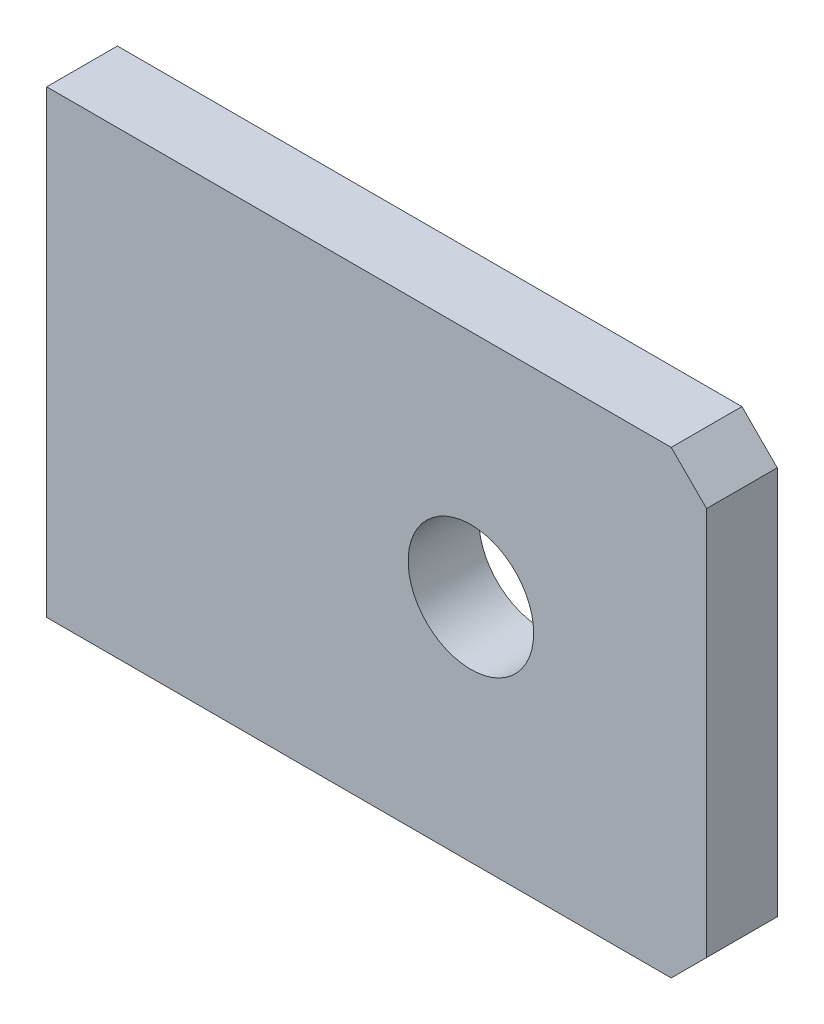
ISO-10303-21;
HEADER;
FILE_DESCRIPTION(('STEP AP214'),'2;1');
FILE_NAME('part.step','',(''),(''),'','','');
FILE_SCHEMA(('AUTOMOTIVE_DESIGN { 1 0 10303 214 1 1 1 1 }'));
ENDSEC;
DATA;
#1=APPLICATION_CONTEXT('core data for automotive mechanical design processes');
#2=APPLICATION_PROTOCOL_DEFINITION('international standard','automotive_design',2000,#1);
#3=PRODUCT_CONTEXT('',#1,'mechanical');
#4=PRODUCT('Part','Part','',(#3));
#5=PRODUCT_RELATED_PRODUCT_CATEGORY('part','',(#4));
#6=PRODUCT_DEFINITION_FORMATION('','',#4);
#7=PRODUCT_DEFINITION_CONTEXT('part definition',#1,'design');
#8=PRODUCT_DEFINITION('design','',#6,#7);
#9=PRODUCT_DEFINITION_SHAPE('','',#8);
#10=(LENGTH_UNIT() NAMED_UNIT(*) SI_UNIT(.MILLI.,.METRE.));
#11=(NAMED_UNIT(*) PLANE_ANGLE_UNIT() SI_UNIT($,.RADIAN.));
#12=(NAMED_UNIT(*) SI_UNIT($,.STERADIAN.) SOLID_ANGLE_UNIT());
#13=UNCERTAINTY_MEASURE_WITH_UNIT(LENGTH_MEASURE(1.E-05),#10,'distance_accuracy_value','');
#14=(GEOMETRIC_REPRESENTATION_CONTEXT(3) GLOBAL_UNCERTAINTY_ASSIGNED_CONTEXT((#13)) GLOBAL_UNIT_ASSIGNED_CONTEXT((#10,
#11,#12)) REPRESENTATION_CONTEXT('',''));
#15=CARTESIAN_POINT('',(0.,0.,0.));
#16=DIRECTION('',(0.,0.,1.));
#17=DIRECTION('',(1.,0.,0.));
#18=AXIS2_PLACEMENT_3D('',#15,#16,#17);
#19=CARTESIAN_POINT('',(0.,0.,0.));
#20=DIRECTION('',(0.,0.,-1.));
#21=DIRECTION('',(-1.,0.,0.));
#22=AXIS2_PLACEMENT_3D('',#19,#20,#21);
#23=PLANE('',#22);
#24=DIRECTION('',(1.,0.,0.));
#25=VECTOR('',#24,1.);
#26=CARTESIAN_POINT('',(-7.112,-4.953,0.));
#27=LINE('',#26,#25);
#28=CARTESIAN_POINT('',(-7.112,-4.953,0.));
#29=VERTEX_POINT('',#28);
#30=CARTESIAN_POINT('',(6.35,-4.953,0.));
#31=VERTEX_POINT('',#30);
#32=EDGE_CURVE('E118',#29,#31,#27,.T.);
#33=ORIENTED_EDGE('',*,*,#32,.T.);
#34=DIRECTION('',(-0.707106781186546,-0.707106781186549,0.));
#35=VECTOR('',#34,1.);
#36=CARTESIAN_POINT('',(6.35,-4.953,0.));
#37=LINE('',#36,#35);
#38=CARTESIAN_POINT('',(7.112,-4.19099999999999,0.));
#39=VERTEX_POINT('',#38);
#40=EDGE_CURVE('E127',#31,#39,#37,.F.);
#41=ORIENTED_EDGE('',*,*,#40,.T.);
#42=DIRECTION('',(0.,1.,0.));
#43=VECTOR('',#42,1.);
#44=CARTESIAN_POINT('',(7.112,-4.953,0.));
#45=LINE('',#44,#43);
#46=CARTESIAN_POINT('',(7.112,4.191,0.));
#47=VERTEX_POINT('',#46);
#48=EDGE_CURVE('E111',#39,#47,#45,.T.);
#49=ORIENTED_EDGE('',*,*,#48,.T.);
#50=DIRECTION('',(0.707106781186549,-0.707106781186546,0.));
#51=VECTOR('',#50,1.);
#52=CARTESIAN_POINT('',(7.112,4.191,0.));
#53=LINE('',#52,#51);
#54=CARTESIAN_POINT('',(6.34999999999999,4.953,0.));
#55=VERTEX_POINT('',#54);
#56=EDGE_CURVE('E125',#47,#55,#53,.F.);
#57=ORIENTED_EDGE('',*,*,#56,.T.);
#58=DIRECTION('',(-1.,0.,0.));
#59=VECTOR('',#58,1.);
#60=CARTESIAN_POINT('',(-7.112,4.953,0.));
#61=LINE('',#60,#59);
#62=CARTESIAN_POINT('',(-7.112,4.953,0.));
#63=VERTEX_POINT('',#62);
#64=EDGE_CURVE('E114',#55,#63,#61,.T.);
#65=ORIENTED_EDGE('',*,*,#64,.T.);
#66=DIRECTION('',(0.,-1.,0.));
#67=VECTOR('',#66,1.);
#68=CARTESIAN_POINT('',(-7.112,-4.953,0.));
#69=LINE('',#68,#67);
#70=EDGE_CURVE('E101',#63,#29,#69,.T.);
#71=ORIENTED_EDGE('',*,*,#70,.T.);
#72=EDGE_LOOP('',(#33,#41,#49,#57,#65,#71));
#73=FACE_BOUND('',#72,.T.);
#74=CARTESIAN_POINT('',(2.032,0.,0.));
#75=DIRECTION('',(0.,0.,1.));
#76=DIRECTION('',(1.,0.,0.));
#77=AXIS2_PLACEMENT_3D('',#74,#75,#76);
#78=CIRCLE('',#77,1.35254999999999);
#79=CARTESIAN_POINT('',(3.38454999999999,0.,0.));
#80=VERTEX_POINT('',#79);
#81=EDGE_CURVE('E179',#80,#80,#78,.T.);
#82=ORIENTED_EDGE('',*,*,#81,.F.);
#83=EDGE_LOOP('',(#82));
#84=FACE_BOUND('',#83,.T.);
#85=ADVANCED_FACE('F36',(#73,#84),#23,.F.);
#86=CARTESIAN_POINT('',(7.112,-4.953,-1.524));
#87=DIRECTION('',(1.,0.,0.));
#88=DIRECTION('',(0.,0.,-1.));
#89=AXIS2_PLACEMENT_3D('',#86,#87,#88);
#90=PLANE('',#89);
#91=ORIENTED_EDGE('',*,*,#48,.F.);
#92=DIRECTION('',(0.,0.,-1.));
#93=VECTOR('',#92,1.);
#94=CARTESIAN_POINT('',(7.112,-4.19099999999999,-1.524));
#95=LINE('',#94,#93);
#96=CARTESIAN_POINT('',(7.112,-4.191,-1.524));
#97=VERTEX_POINT('',#96);
#98=EDGE_CURVE('E132',#39,#97,#95,.T.);
#99=ORIENTED_EDGE('',*,*,#98,.T.);
#100=DIRECTION('',(0.,1.,0.));
#101=VECTOR('',#100,1.);
#102=CARTESIAN_POINT('',(7.112,-4.953,-1.524));
#103=LINE('',#102,#101);
#104=CARTESIAN_POINT('',(7.112,4.191,-1.524));
#105=VERTEX_POINT('',#104);
#106=EDGE_CURVE('E94',#97,#105,#103,.T.);
#107=ORIENTED_EDGE('',*,*,#106,.T.);
#108=DIRECTION('',(0.,0.,1.));
#109=VECTOR('',#108,1.);
#110=CARTESIAN_POINT('',(7.112,4.191,-1.524));
#111=LINE('',#110,#109);
#112=EDGE_CURVE('E129',#105,#47,#111,.T.);
#113=ORIENTED_EDGE('',*,*,#112,.T.);
#114=EDGE_LOOP('',(#91,#99,#107,#113));
#115=FACE_BOUND('',#114,.T.);
#116=ADVANCED_FACE('F146',(#115),#90,.T.);
#117=CARTESIAN_POINT('',(-7.112,-4.953,-1.524));
#118=DIRECTION('',(0.,-1.,0.));
#119=DIRECTION('',(0.,0.,-1.));
#120=AXIS2_PLACEMENT_3D('',#117,#118,#119);
#121=PLANE('',#120);
#122=DIRECTION('',(1.,0.,0.));
#123=VECTOR('',#122,1.);
#124=CARTESIAN_POINT('',(-7.112,-4.953,-1.524));
#125=LINE('',#124,#123);
#126=CARTESIAN_POINT('',(-7.112,-4.953,-1.524));
#127=VERTEX_POINT('',#126);
#128=CARTESIAN_POINT('',(6.35,-4.953,-1.524));
#129=VERTEX_POINT('',#128);
#130=EDGE_CURVE('E103',#127,#129,#125,.T.);
#131=ORIENTED_EDGE('',*,*,#130,.T.);
#132=DIRECTION('',(0.,0.,1.));
#133=VECTOR('',#132,1.);
#134=CARTESIAN_POINT('',(6.35,-4.953,-1.524));
#135=LINE('',#134,#133);
#136=EDGE_CURVE('E121',#129,#31,#135,.T.);
#137=ORIENTED_EDGE('',*,*,#136,.T.);
#138=ORIENTED_EDGE('',*,*,#32,.F.);
#139=DIRECTION('',(0.,0.,1.));
#140=VECTOR('',#139,1.);
#141=CARTESIAN_POINT('',(-7.112,-4.953,-1.524));
#142=LINE('',#141,#140);
#143=EDGE_CURVE('E102',#127,#29,#142,.T.);
#144=ORIENTED_EDGE('',*,*,#143,.F.);
#145=EDGE_LOOP('',(#131,#137,#138,#144));
#146=FACE_BOUND('',#145,.T.);
#147=ADVANCED_FACE('F139',(#146),#121,.T.);
#148=CARTESIAN_POINT('',(-7.112,-4.953,-1.524));
#149=DIRECTION('',(-1.,0.,0.));
#150=DIRECTION('',(0.,0.,1.));
#151=AXIS2_PLACEMENT_3D('',#148,#149,#150);
#152=PLANE('',#151);
#153=ORIENTED_EDGE('',*,*,#70,.F.);
#154=DIRECTION('',(0.,0.,1.));
#155=VECTOR('',#154,1.);
#156=CARTESIAN_POINT('',(-7.112,4.953,-1.524));
#157=LINE('',#156,#155);
#158=CARTESIAN_POINT('',(-7.112,4.953,-1.524));
#159=VERTEX_POINT('',#158);
#160=EDGE_CURVE('E90',#159,#63,#157,.T.);
#161=ORIENTED_EDGE('',*,*,#160,.F.);
#162=DIRECTION('',(0.,-1.,0.));
#163=VECTOR('',#162,1.);
#164=CARTESIAN_POINT('',(-7.112,-4.953,-1.524));
#165=LINE('',#164,#163);
#166=EDGE_CURVE('E93',#159,#127,#165,.T.);
#167=ORIENTED_EDGE('',*,*,#166,.T.);
#168=ORIENTED_EDGE('',*,*,#143,.T.);
#169=EDGE_LOOP('',(#153,#161,#167,#168));
#170=FACE_BOUND('',#169,.T.);
#171=ADVANCED_FACE('F98',(#170),#152,.T.);
#172=CARTESIAN_POINT('',(-7.112,4.953,-1.524));
#173=DIRECTION('',(0.,1.,0.));
#174=DIRECTION('',(0.,0.,1.));
#175=AXIS2_PLACEMENT_3D('',#172,#173,#174);
#176=PLANE('',#175);
#177=ORIENTED_EDGE('',*,*,#64,.F.);
#178=DIRECTION('',(0.,0.,-1.));
#179=VECTOR('',#178,1.);
#180=CARTESIAN_POINT('',(6.34999999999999,4.953,-1.524));
#181=LINE('',#180,#179);
#182=CARTESIAN_POINT('',(6.34999999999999,4.953,-1.524));
#183=VERTEX_POINT('',#182);
#184=EDGE_CURVE('E11',#55,#183,#181,.T.);
#185=ORIENTED_EDGE('',*,*,#184,.T.);
#186=DIRECTION('',(-1.,0.,0.));
#187=VECTOR('',#186,1.);
#188=CARTESIAN_POINT('',(-7.112,4.953,-1.524));
#189=LINE('',#188,#187);
#190=EDGE_CURVE('E87',#183,#159,#189,.T.);
#191=ORIENTED_EDGE('',*,*,#190,.T.);
#192=ORIENTED_EDGE('',*,*,#160,.T.);
#193=EDGE_LOOP('',(#177,#185,#191,#192));
#194=FACE_BOUND('',#193,.T.);
#195=ADVANCED_FACE('F89',(#194),#176,.T.);
#196=CARTESIAN_POINT('',(0.,0.,-1.524));
#197=DIRECTION('',(0.,0.,-1.));
#198=DIRECTION('',(-1.,0.,0.));
#199=AXIS2_PLACEMENT_3D('',#196,#197,#198);
#200=PLANE('',#199);
#201=CARTESIAN_POINT('',(2.032,0.,-1.524));
#202=DIRECTION('',(0.,0.,-1.));
#203=DIRECTION('',(-1.,0.,0.));
#204=AXIS2_PLACEMENT_3D('',#201,#202,#203);
#205=CIRCLE('',#204,1.35254999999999);
#206=CARTESIAN_POINT('',(0.679450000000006,0.,-1.524));
#207=VERTEX_POINT('',#206);
#208=EDGE_CURVE('E115',#207,#207,#205,.T.);
#209=ORIENTED_EDGE('',*,*,#208,.F.);
#210=EDGE_LOOP('',(#209));
#211=FACE_BOUND('',#210,.T.);
#212=ORIENTED_EDGE('',*,*,#106,.F.);
#213=DIRECTION('',(0.707106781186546,0.707106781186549,0.));
#214=VECTOR('',#213,1.);
#215=CARTESIAN_POINT('',(5.65150000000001,-5.65149999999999,-1.524));
#216=LINE('',#215,#214);
#217=EDGE_CURVE('E44',#97,#129,#216,.F.);
#218=ORIENTED_EDGE('',*,*,#217,.T.);
#219=ORIENTED_EDGE('',*,*,#130,.F.);
#220=ORIENTED_EDGE('',*,*,#166,.F.);
#221=ORIENTED_EDGE('',*,*,#190,.F.);
#222=DIRECTION('',(-0.707106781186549,0.707106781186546,0.));
#223=VECTOR('',#222,1.);
#224=CARTESIAN_POINT('',(5.65149999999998,5.65150000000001,-1.524));
#225=LINE('',#224,#223);
#226=EDGE_CURVE('E56',#183,#105,#225,.F.);
#227=ORIENTED_EDGE('',*,*,#226,.T.);
#228=EDGE_LOOP('',(#212,#218,#219,#220,#221,#227));
#229=FACE_BOUND('',#228,.T.);
#230=ADVANCED_FACE('F105',(#211,#229),#200,.T.);
#231=CARTESIAN_POINT('',(6.35,-4.953,-1.524));
#232=DIRECTION('',(-0.707106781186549,0.707106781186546,0.));
#233=DIRECTION('',(0.,0.,1.));
#234=AXIS2_PLACEMENT_3D('',#231,#232,#233);
#235=PLANE('',#234);
#236=ORIENTED_EDGE('',*,*,#217,.F.);
#237=ORIENTED_EDGE('',*,*,#98,.F.);
#238=ORIENTED_EDGE('',*,*,#40,.F.);
#239=ORIENTED_EDGE('',*,*,#136,.F.);
#240=EDGE_LOOP('',(#236,#237,#238,#239));
#241=FACE_BOUND('',#240,.T.);
#242=ADVANCED_FACE('F141',(#241),#235,.F.);
#243=CARTESIAN_POINT('',(7.112,4.191,-1.524));
#244=DIRECTION('',(-0.707106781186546,-0.707106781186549,0.));
#245=DIRECTION('',(0.,0.,1.));
#246=AXIS2_PLACEMENT_3D('',#243,#244,#245);
#247=PLANE('',#246);
#248=ORIENTED_EDGE('',*,*,#226,.F.);
#249=ORIENTED_EDGE('',*,*,#184,.F.);
#250=ORIENTED_EDGE('',*,*,#56,.F.);
#251=ORIENTED_EDGE('',*,*,#112,.F.);
#252=EDGE_LOOP('',(#248,#249,#250,#251));
#253=FACE_BOUND('',#252,.T.);
#254=ADVANCED_FACE('F38',(#253),#247,.F.);
#255=CARTESIAN_POINT('',(2.032,0.,0.));
#256=DIRECTION('',(0.,0.,1.));
#257=DIRECTION('',(1.,0.,0.));
#258=AXIS2_PLACEMENT_3D('',#255,#256,#257);
#259=CYLINDRICAL_SURFACE('',#258,1.35254999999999);
#260=ORIENTED_EDGE('',*,*,#81,.T.);
#261=EDGE_LOOP('',(#260));
#262=FACE_BOUND('',#261,.T.);
#263=ORIENTED_EDGE('',*,*,#208,.T.);
#264=EDGE_LOOP('',(#263));
#265=FACE_BOUND('',#264,.T.);
#266=ADVANCED_FACE('F150',(#262,#265),#259,.F.);
#267=CLOSED_SHELL('',(#85,#116,#147,#171,#195,#230,#242,#254,#266));
#268=MANIFOLD_SOLID_BREP('B2',#267);
#269=ADVANCED_BREP_SHAPE_REPRESENTATION('',(#18,#268),#14);
#270=SHAPE_DEFINITION_REPRESENTATION(#9,#269);
ENDSEC;
END-ISO-10303-21;
